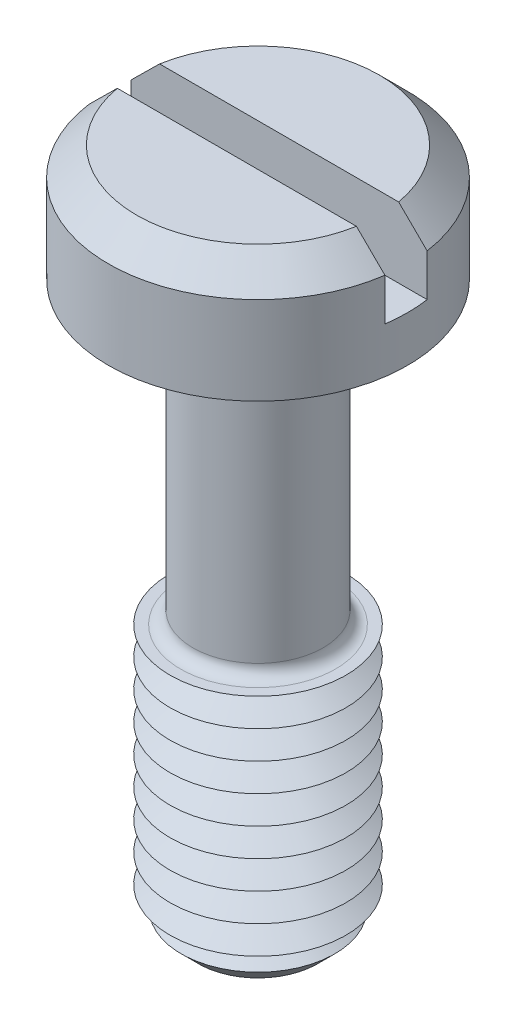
ISO-10303-21;
HEADER;
FILE_DESCRIPTION(('STEP AP214'),'2;1');
FILE_NAME('part.step','',(''),(''),'','','');
FILE_SCHEMA(('AUTOMOTIVE_DESIGN { 1 0 10303 214 1 1 1 1 }'));
ENDSEC;
DATA;
#1=APPLICATION_CONTEXT('core data for automotive mechanical design processes');
#2=APPLICATION_PROTOCOL_DEFINITION('international standard','automotive_design',2000,#1);
#3=PRODUCT_CONTEXT('',#1,'mechanical');
#4=PRODUCT('Part','Part','',(#3));
#5=PRODUCT_RELATED_PRODUCT_CATEGORY('part','',(#4));
#6=PRODUCT_DEFINITION_FORMATION('','',#4);
#7=PRODUCT_DEFINITION_CONTEXT('part definition',#1,'design');
#8=PRODUCT_DEFINITION('design','',#6,#7);
#9=PRODUCT_DEFINITION_SHAPE('','',#8);
#10=(LENGTH_UNIT() NAMED_UNIT(*) SI_UNIT(.MILLI.,.METRE.));
#11=(NAMED_UNIT(*) PLANE_ANGLE_UNIT() SI_UNIT($,.RADIAN.));
#12=(NAMED_UNIT(*) SI_UNIT($,.STERADIAN.) SOLID_ANGLE_UNIT());
#13=UNCERTAINTY_MEASURE_WITH_UNIT(LENGTH_MEASURE(1.E-05),#10,'distance_accuracy_value','');
#14=(GEOMETRIC_REPRESENTATION_CONTEXT(3) GLOBAL_UNCERTAINTY_ASSIGNED_CONTEXT((#13)) GLOBAL_UNIT_ASSIGNED_CONTEXT((#10,
#11,#12)) REPRESENTATION_CONTEXT('',''));
#15=CARTESIAN_POINT('',(0.,0.,0.));
#16=DIRECTION('',(0.,0.,1.));
#17=DIRECTION('',(1.,0.,0.));
#18=AXIS2_PLACEMENT_3D('',#15,#16,#17);
#19=CARTESIAN_POINT('',(0.,3.3,0.));
#20=DIRECTION('',(0.,1.,0.));
#21=DIRECTION('',(0.,0.,1.));
#22=AXIS2_PLACEMENT_3D('',#19,#20,#21);
#23=PLANE('',#22);
#24=DIRECTION('',(-1.,0.,0.));
#25=VECTOR('',#24,1.);
#26=CARTESIAN_POINT('',(4.25,3.3,-0.6));
#27=LINE('',#26,#25);
#28=CARTESIAN_POINT('',(3.39742549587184,3.3,-0.6));
#29=VERTEX_POINT('',#28);
#30=CARTESIAN_POINT('',(-3.39742549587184,3.3,-0.6));
#31=VERTEX_POINT('',#30);
#32=EDGE_CURVE('E110',#29,#31,#27,.T.);
#33=ORIENTED_EDGE('',*,*,#32,.F.);
#34=CARTESIAN_POINT('',(0.,3.3,0.));
#35=DIRECTION('',(0.,1.,0.));
#36=DIRECTION('',(0.,0.,1.));
#37=AXIS2_PLACEMENT_3D('',#34,#35,#36);
#38=CIRCLE('',#37,3.45000000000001);
#39=EDGE_CURVE('E113',#29,#31,#38,.T.);
#40=ORIENTED_EDGE('',*,*,#39,.T.);
#41=EDGE_LOOP('',(#33,#40));
#42=FACE_BOUND('',#41,.T.);
#43=ADVANCED_FACE('F39',(#42),#23,.T.);
#44=CARTESIAN_POINT('',(0.,3.3,0.));
#45=DIRECTION('',(0.,-1.,0.));
#46=DIRECTION('',(0.,0.,-1.));
#47=AXIS2_PLACEMENT_3D('',#44,#45,#46);
#48=CONICAL_SURFACE('',#47,3.45000000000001,0.785398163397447);
#49=CARTESIAN_POINT('',(9.35351408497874,-2.62273843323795,-0.6));
#50=CARTESIAN_POINT('',(9.03263557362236,-2.3025231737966,-0.6));
#51=CARTESIAN_POINT('',(8.71172811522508,-1.9823369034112,-0.6));
#52=CARTESIAN_POINT('',(8.06981262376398,-1.34205341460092,-0.6));
#53=CARTESIAN_POINT('',(7.74880458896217,-1.02195619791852,-0.6));
#54=CARTESIAN_POINT('',(7.10652460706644,-0.381761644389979,-0.6));
#55=CARTESIAN_POINT('',(6.78525260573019,-0.061664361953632,-0.6));
#56=CARTESIAN_POINT('',(6.14251393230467,0.578323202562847,-0.6));
#57=CARTESIAN_POINT('',(5.82104726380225,0.898213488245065,-0.6));
#58=CARTESIAN_POINT('',(5.17196209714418,1.54347500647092,-0.6));
#59=CARTESIAN_POINT('',(4.84433778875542,1.86884039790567,-0.6));
#60=CARTESIAN_POINT('',(4.35244442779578,2.35644593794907,-0.6));
#61=CARTESIAN_POINT('',(4.18839924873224,2.51891187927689,-0.6));
#62=CARTESIAN_POINT('',(3.86009606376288,2.84362679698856,-0.6));
#63=CARTESIAN_POINT('',(3.69583805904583,3.00587577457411,-0.6));
#64=CARTESIAN_POINT('',(3.36705354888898,3.33001661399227,-0.6));
#65=CARTESIAN_POINT('',(3.20252712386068,3.49190855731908,-0.6));
#66=CARTESIAN_POINT('',(2.87298689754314,3.81520272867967,-0.6));
#67=CARTESIAN_POINT('',(2.70797308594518,3.97660494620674,-0.6));
#68=CARTESIAN_POINT('',(2.37716903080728,4.29858210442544,-0.6));
#69=CARTESIAN_POINT('',(2.21137886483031,4.45915712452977,-0.6));
#70=CARTESIAN_POINT('',(1.96157219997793,4.69884609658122,-0.6));
#71=CARTESIAN_POINT('',(1.87811785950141,4.77854546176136,-0.6));
#72=CARTESIAN_POINT('',(1.71066064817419,4.93736532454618,-0.6));
#73=CARTESIAN_POINT('',(1.62665778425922,5.01648582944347,-0.6));
#74=CARTESIAN_POINT('',(1.49655488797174,5.13773269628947,-0.6));
#75=CARTESIAN_POINT('',(1.45074972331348,5.18017521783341,-0.6));
#76=CARTESIAN_POINT('',(1.35882119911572,5.26471614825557,-0.6));
#77=CARTESIAN_POINT('',(1.31269783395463,5.30681455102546,-0.6));
#78=CARTESIAN_POINT('',(1.22008852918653,5.39050695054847,-0.6));
#79=CARTESIAN_POINT('',(1.17360305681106,5.43210146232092,-0.6));
#80=CARTESIAN_POINT('',(1.08007401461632,5.51465347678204,-0.6));
#81=CARTESIAN_POINT('',(1.03303046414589,5.55561100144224,-0.6));
#82=CARTESIAN_POINT('',(0.919047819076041,5.65299331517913,-0.6));
#83=CARTESIAN_POINT('',(0.851738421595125,5.7089924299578,-0.6));
#84=CARTESIAN_POINT('',(0.748806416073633,5.79068526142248,-0.6));
#85=CARTESIAN_POINT('',(0.714125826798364,5.8175621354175,-0.6));
#86=CARTESIAN_POINT('',(0.643915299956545,5.87018079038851,-0.6));
#87=CARTESIAN_POINT('',(0.608385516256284,5.89592277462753,-0.6));
#88=CARTESIAN_POINT('',(0.545162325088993,5.93955652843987,-0.6));
#89=CARTESIAN_POINT('',(0.517718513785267,5.95780799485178,-0.6));
#90=CARTESIAN_POINT('',(0.462025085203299,5.99303174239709,-0.6));
#91=CARTESIAN_POINT('',(0.433775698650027,6.01000438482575,-0.6));
#92=CARTESIAN_POINT('',(0.376341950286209,6.04213837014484,-0.6));
#93=CARTESIAN_POINT('',(0.347160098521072,6.05730412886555,-0.6));
#94=CARTESIAN_POINT('',(0.2876425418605,6.08513394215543,-0.6));
#95=CARTESIAN_POINT('',(0.25730803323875,6.09780051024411,-0.6));
#96=CARTESIAN_POINT('',(0.190863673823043,6.12124627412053,-0.6));
#97=CARTESIAN_POINT('',(0.154554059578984,6.13148571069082,-0.6));
#98=CARTESIAN_POINT('',(0.0807909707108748,6.14565404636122,-0.6));
#99=CARTESIAN_POINT('',(0.0433423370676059,6.14960664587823,-0.6));
#100=CARTESIAN_POINT('',(-0.0317987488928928,6.1503378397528,-0.6));
#101=CARTESIAN_POINT('',(-0.0694915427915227,6.14708428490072,-0.6));
#102=CARTESIAN_POINT('',(-0.143790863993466,6.13410921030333,-0.6));
#103=CARTESIAN_POINT('',(-0.180393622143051,6.12436747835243,-0.6));
#104=CARTESIAN_POINT('',(-0.25409852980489,6.09939647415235,-0.6));
#105=CARTESIAN_POINT('',(-0.29109483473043,6.08386859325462,-0.6));
#106=CARTESIAN_POINT('',(-0.363408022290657,6.04924663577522,-0.6));
#107=CARTESIAN_POINT('',(-0.398721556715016,6.03014579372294,-0.6));
#108=CARTESIAN_POINT('',(-0.468234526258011,5.98944452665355,-0.6));
#109=CARTESIAN_POINT('',(-0.502422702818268,5.96782521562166,-0.6));
#110=CARTESIAN_POINT('',(-0.569689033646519,5.92300618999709,-0.6));
#111=CARTESIAN_POINT('',(-0.602768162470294,5.89980792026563,-0.6));
#112=CARTESIAN_POINT('',(-0.671148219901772,5.85008963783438,-0.6));
#113=CARTESIAN_POINT('',(-0.706369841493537,5.82346130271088,-0.6));
#114=CARTESIAN_POINT('',(-0.776087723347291,5.76926828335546,-0.6));
#115=CARTESIAN_POINT('',(-0.810583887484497,5.74170347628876,-0.6));
#116=CARTESIAN_POINT('',(-0.913286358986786,5.65798278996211,-0.6));
#117=CARTESIAN_POINT('',(-0.98067372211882,5.60082541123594,-0.6));
#118=CARTESIAN_POINT('',(-1.11424616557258,5.48490670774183,-0.6));
#119=CARTESIAN_POINT('',(-1.18042891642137,5.42614273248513,-0.6));
#120=CARTESIAN_POINT('',(-1.31191262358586,5.30767463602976,-0.6));
#121=CARTESIAN_POINT('',(-1.37721382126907,5.24797078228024,-0.6));
#122=CARTESIAN_POINT('',(-1.5070108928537,5.12812906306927,-0.6));
#123=CARTESIAN_POINT('',(-1.57150872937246,5.06799331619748,-0.6));
#124=CARTESIAN_POINT('',(-1.7000913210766,4.94727328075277,-0.6));
#125=CARTESIAN_POINT('',(-1.76417604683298,4.88668896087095,-0.6));
#126=CARTESIAN_POINT('',(-1.95584105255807,4.70458824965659,-0.6));
#127=CARTESIAN_POINT('',(-2.08296922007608,4.58259645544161,-0.6));
#128=CARTESIAN_POINT('',(-2.33599178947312,4.33840625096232,-0.6));
#129=CARTESIAN_POINT('',(-2.46188913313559,4.21621087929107,-0.6));
#130=CARTESIAN_POINT('',(-2.71323511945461,3.97135925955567,-0.6));
#131=CARTESIAN_POINT('',(-2.8386837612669,3.84870301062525,-0.6));
#132=CARTESIAN_POINT('',(-3.21459106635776,3.48027743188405,-0.6));
#133=CARTESIAN_POINT('',(-3.46460626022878,3.23405597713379,-0.6));
#134=CARTESIAN_POINT('',(-3.96413793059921,2.7409031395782,-0.6));
#135=CARTESIAN_POINT('',(-4.21365415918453,2.49397150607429,-0.6));
#136=CARTESIAN_POINT('',(-4.71232475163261,1.99974737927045,-0.6));
#137=CARTESIAN_POINT('',(-4.96147911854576,1.75245488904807,-0.6));
#138=CARTESIAN_POINT('',(-5.45958725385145,1.25761544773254,-0.6));
#139=CARTESIAN_POINT('',(-5.70854099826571,1.01006847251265,-0.6));
#140=CARTESIAN_POINT('',(-6.20629498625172,0.514819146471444,-0.6));
#141=CARTESIAN_POINT('',(-6.45509522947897,0.267116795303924,-0.6));
#142=CARTESIAN_POINT('',(-7.20128563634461,-0.476100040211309,-0.6));
#143=CARTESIAN_POINT('',(-7.69851620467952,-0.971774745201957,-0.6));
#144=CARTESIAN_POINT('',(-8.38865115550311,-1.66007026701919,-0.6));
#145=CARTESIAN_POINT('',(-8.58165346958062,-1.85259293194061,-0.6));
#146=CARTESIAN_POINT('',(-8.87112736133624,-2.14139225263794,-0.6));
#147=CARTESIAN_POINT('',(-8.96761014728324,-2.23765767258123,-0.6));
#148=CARTESIAN_POINT('',(-9.16056764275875,-2.43019387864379,-0.6));
#149=CARTESIAN_POINT('',(-9.25704235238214,-2.52646466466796,-0.6));
#150=CARTESIAN_POINT('',(-9.35351408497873,-2.62273843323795,-0.6));
#151=B_SPLINE_CURVE_WITH_KNOTS('',3,(#49,#50,#51,#52,#53,#54,#55,#56,#57,#58,#59,#60,#61,#62,
#63,#64,#65,#66,#67,#68,#69,#70,#71,#72,#73,#74,#75,#76,#77,#78,#79,#80,#81,#82,#83,#84,#85,#86,
#87,#88,#89,#90,#91,#92,#93,#94,#95,#96,#97,#98,#99,#100,#101,#102,#103,#104,#105,#106,#107,
#108,#109,#110,#111,#112,#113,#114,#115,#116,#117,#118,#119,#120,#121,#122,#123,#124,#125,#126,
#127,#128,#129,#130,#131,#132,#133,#134,#135,#136,#137,#138,#139,#140,#141,#142,#143,#144,#145,
#146,#147,#148,#149,#150),.UNSPECIFIED.,.F.,.F.,(4,2,2,2,2,2,2,2,2,2,2,2,2,2,2,2,2,2,2,2,2,2,2,
2,2,2,2,2,2,2,2,2,2,2,2,2,2,2,2,2,2,2,2,2,2,2,2,2,2,2,4),(0.,1.35996600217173,2.71995696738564,
4.08050889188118,5.44103646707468,6.82624457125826,7.5188872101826,8.21152599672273,
8.9039856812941,9.59646011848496,10.288866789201,10.635058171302,10.9812451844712,
11.1685812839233,11.3559207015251,11.5430489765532,11.7301707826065,11.9927784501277,
12.1243921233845,12.2559821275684,12.3548333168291,12.4536564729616,12.5522329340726,
12.6507097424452,12.763461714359,12.8757876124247,12.9886156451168,13.101796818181,
13.2218851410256,13.3422031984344,13.4634899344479,13.584667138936,13.7171086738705,
13.8495676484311,14.1146090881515,14.3801178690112,14.6455524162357,14.910099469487,
15.17466516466,15.7032346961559,16.2295761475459,16.7559185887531,17.8086237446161,
18.8617626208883,19.9148925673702,20.9681337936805,22.0213773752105,24.1276499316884,
24.9454725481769,25.354353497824,25.7632286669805),.UNSPECIFIED.);
#152=CARTESIAN_POINT('',(4.20743389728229,2.5,-0.6));
#153=VERTEX_POINT('',#152);
#154=EDGE_CURVE('E268',#153,#29,#151,.T.);
#155=ORIENTED_EDGE('',*,*,#154,.F.);
#156=CARTESIAN_POINT('',(0.,2.5,0.));
#157=DIRECTION('',(0.,1.,0.));
#158=DIRECTION('',(0.,0.,1.));
#159=AXIS2_PLACEMENT_3D('',#156,#157,#158);
#160=CIRCLE('',#159,4.25);
#161=CARTESIAN_POINT('',(-4.20743389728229,2.5,-0.6));
#162=VERTEX_POINT('',#161);
#163=EDGE_CURVE('E128',#162,#153,#160,.F.);
#164=ORIENTED_EDGE('',*,*,#163,.F.);
#165=EDGE_CURVE('E102',#31,#162,#151,.T.);
#166=ORIENTED_EDGE('',*,*,#165,.F.);
#167=ORIENTED_EDGE('',*,*,#39,.F.);
#168=EDGE_LOOP('',(#155,#164,#166,#167));
#169=FACE_BOUND('',#168,.T.);
#170=ADVANCED_FACE('F230',(#169),#48,.T.);
#171=CARTESIAN_POINT('',(0.,-16.,0.));
#172=DIRECTION('',(0.,1.,0.));
#173=DIRECTION('',(0.,0.,1.));
#174=AXIS2_PLACEMENT_3D('',#171,#172,#173);
#175=CYLINDRICAL_SURFACE('',#174,1.85);
#176=CARTESIAN_POINT('',(0.,-8.15,0.));
#177=DIRECTION('',(0.,-1.,0.));
#178=DIRECTION('',(0.,0.,-1.));
#179=AXIS2_PLACEMENT_3D('',#176,#177,#178);
#180=CIRCLE('',#179,1.85);
#181=CARTESIAN_POINT('',(0.,-8.15,-1.85));
#182=VERTEX_POINT('',#181);
#183=EDGE_CURVE('E123',#182,#182,#180,.F.);
#184=ORIENTED_EDGE('',*,*,#183,.T.);
#185=EDGE_LOOP('',(#184));
#186=FACE_BOUND('',#185,.T.);
#187=CARTESIAN_POINT('',(0.,-0.35,0.));
#188=DIRECTION('',(0.,1.,0.));
#189=DIRECTION('',(0.,0.,1.));
#190=AXIS2_PLACEMENT_3D('',#187,#188,#189);
#191=CIRCLE('',#190,1.85);
#192=CARTESIAN_POINT('',(0.,-0.35,1.85));
#193=VERTEX_POINT('',#192);
#194=EDGE_CURVE('E381',#193,#193,#191,.F.);
#195=ORIENTED_EDGE('',*,*,#194,.T.);
#196=EDGE_LOOP('',(#195));
#197=FACE_BOUND('',#196,.T.);
#198=ADVANCED_FACE('F226',(#186,#197),#175,.T.);
#199=CARTESIAN_POINT('',(0.,3.3,0.));
#200=DIRECTION('',(0.,-1.,0.));
#201=DIRECTION('',(0.,0.,-1.));
#202=AXIS2_PLACEMENT_3D('',#199,#200,#201);
#203=CYLINDRICAL_SURFACE('',#202,4.25);
#204=ORIENTED_EDGE('',*,*,#163,.T.);
#205=DIRECTION('',(0.,-1.,0.));
#206=VECTOR('',#205,1.);
#207=CARTESIAN_POINT('',(4.20743389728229,3.3,-0.6));
#208=LINE('',#207,#206);
#209=CARTESIAN_POINT('',(4.20743389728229,1.3,-0.6));
#210=VERTEX_POINT('',#209);
#211=EDGE_CURVE('E64',#153,#210,#208,.T.);
#212=ORIENTED_EDGE('',*,*,#211,.T.);
#213=CARTESIAN_POINT('',(0.,1.3,0.));
#214=DIRECTION('',(0.,1.,0.));
#215=DIRECTION('',(0.,0.,1.));
#216=AXIS2_PLACEMENT_3D('',#213,#214,#215);
#217=CIRCLE('',#216,4.25);
#218=CARTESIAN_POINT('',(4.20743389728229,1.3,0.6));
#219=VERTEX_POINT('',#218);
#220=EDGE_CURVE('E11',#219,#210,#217,.T.);
#221=ORIENTED_EDGE('',*,*,#220,.F.);
#222=DIRECTION('',(0.,-1.,0.));
#223=VECTOR('',#222,1.);
#224=CARTESIAN_POINT('',(4.20743389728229,3.3,0.6));
#225=LINE('',#224,#223);
#226=CARTESIAN_POINT('',(4.20743389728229,2.5,0.6));
#227=VERTEX_POINT('',#226);
#228=EDGE_CURVE('E283',#219,#227,#225,.F.);
#229=ORIENTED_EDGE('',*,*,#228,.T.);
#230=CARTESIAN_POINT('',(-4.20743389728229,2.5,0.6));
#231=VERTEX_POINT('',#230);
#232=EDGE_CURVE('E120',#227,#231,#160,.F.);
#233=ORIENTED_EDGE('',*,*,#232,.T.);
#234=DIRECTION('',(0.,-1.,0.));
#235=VECTOR('',#234,1.);
#236=CARTESIAN_POINT('',(-4.20743389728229,3.3,0.6));
#237=LINE('',#236,#235);
#238=CARTESIAN_POINT('',(-4.20743389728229,1.3,0.6));
#239=VERTEX_POINT('',#238);
#240=EDGE_CURVE('E96',#231,#239,#237,.T.);
#241=ORIENTED_EDGE('',*,*,#240,.T.);
#242=CARTESIAN_POINT('',(-4.20743389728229,1.3,-0.6));
#243=VERTEX_POINT('',#242);
#244=EDGE_CURVE('E44',#243,#239,#217,.T.);
#245=ORIENTED_EDGE('',*,*,#244,.F.);
#246=DIRECTION('',(0.,-1.,0.));
#247=VECTOR('',#246,1.);
#248=CARTESIAN_POINT('',(-4.20743389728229,3.3,-0.6));
#249=LINE('',#248,#247);
#250=EDGE_CURVE('E288',#243,#162,#249,.F.);
#251=ORIENTED_EDGE('',*,*,#250,.T.);
#252=EDGE_LOOP('',(#204,#212,#221,#229,#233,#241,#245,#251));
#253=FACE_BOUND('',#252,.T.);
#254=CARTESIAN_POINT('',(0.,0.,0.));
#255=DIRECTION('',(0.,1.,0.));
#256=DIRECTION('',(0.,0.,1.));
#257=AXIS2_PLACEMENT_3D('',#254,#255,#256);
#258=CIRCLE('',#257,4.25);
#259=CARTESIAN_POINT('',(0.,0.,4.25));
#260=VERTEX_POINT('',#259);
#261=EDGE_CURVE('E369',#260,#260,#258,.T.);
#262=ORIENTED_EDGE('',*,*,#261,.T.);
#263=EDGE_LOOP('',(#262));
#264=FACE_BOUND('',#263,.T.);
#265=ADVANCED_FACE('F229',(#253,#264),#203,.T.);
#266=DIRECTION('',(1.,0.,0.));
#267=VECTOR('',#266,1.);
#268=CARTESIAN_POINT('',(4.25,3.3,0.6));
#269=LINE('',#268,#267);
#270=CARTESIAN_POINT('',(-3.39742549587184,3.3,0.6));
#271=VERTEX_POINT('',#270);
#272=CARTESIAN_POINT('',(3.39742549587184,3.3,0.6));
#273=VERTEX_POINT('',#272);
#274=EDGE_CURVE('E56',#271,#273,#269,.T.);
#275=ORIENTED_EDGE('',*,*,#274,.F.);
#276=EDGE_CURVE('E108',#271,#273,#38,.T.);
#277=ORIENTED_EDGE('',*,*,#276,.T.);
#278=EDGE_LOOP('',(#275,#277));
#279=FACE_BOUND('',#278,.T.);
#280=ADVANCED_FACE('F107',(#279),#23,.T.);
#281=CARTESIAN_POINT('',(0.,0.,0.));
#282=DIRECTION('',(0.,1.,0.));
#283=DIRECTION('',(0.,0.,1.));
#284=AXIS2_PLACEMENT_3D('',#281,#282,#283);
#285=PLANE('',#284);
#286=CARTESIAN_POINT('',(0.,0.,0.));
#287=DIRECTION('',(0.,1.,0.));
#288=DIRECTION('',(0.,0.,1.));
#289=AXIS2_PLACEMENT_3D('',#286,#287,#288);
#290=CIRCLE('',#289,2.2);
#291=CARTESIAN_POINT('',(0.,0.,2.2));
#292=VERTEX_POINT('',#291);
#293=EDGE_CURVE('E114',#292,#292,#290,.T.);
#294=ORIENTED_EDGE('',*,*,#293,.T.);
#295=EDGE_LOOP('',(#294));
#296=FACE_BOUND('',#295,.T.);
#297=ORIENTED_EDGE('',*,*,#261,.F.);
#298=EDGE_LOOP('',(#297));
#299=FACE_BOUND('',#298,.T.);
#300=ADVANCED_FACE('F220',(#296,#299),#285,.F.);
#301=CARTESIAN_POINT('',(0.,-8.5,0.));
#302=DIRECTION('',(0.,-1.,0.));
#303=DIRECTION('',(0.,0.,-1.));
#304=AXIS2_PLACEMENT_3D('',#301,#302,#303);
#305=PLANE('',#304);
#306=CARTESIAN_POINT('',(0.,-8.5,0.));
#307=DIRECTION('',(0.,-1.,0.));
#308=DIRECTION('',(0.,0.,-1.));
#309=AXIS2_PLACEMENT_3D('',#306,#307,#308);
#310=CIRCLE('',#309,2.2);
#311=CARTESIAN_POINT('',(0.,-8.5,-2.2));
#312=VERTEX_POINT('',#311);
#313=EDGE_CURVE('E376',#312,#312,#310,.T.);
#314=ORIENTED_EDGE('',*,*,#313,.T.);
#315=EDGE_LOOP('',(#314));
#316=FACE_BOUND('',#315,.T.);
#317=CARTESIAN_POINT('',(0.,-8.5,0.));
#318=DIRECTION('',(0.,1.,0.));
#319=DIRECTION('',(0.,0.,1.));
#320=AXIS2_PLACEMENT_3D('',#317,#318,#319);
#321=CIRCLE('',#320,2.5);
#322=CARTESIAN_POINT('',(0.,-8.5,2.5));
#323=VERTEX_POINT('',#322);
#324=EDGE_CURVE('E365',#323,#323,#321,.T.);
#325=ORIENTED_EDGE('',*,*,#324,.T.);
#326=EDGE_LOOP('',(#325));
#327=FACE_BOUND('',#326,.T.);
#328=ADVANCED_FACE('F216',(#316,#327),#305,.F.);
#329=CARTESIAN_POINT('',(0.,-8.9,0.));
#330=DIRECTION('',(0.,1.,0.));
#331=DIRECTION('',(0.,0.,1.));
#332=AXIS2_PLACEMENT_3D('',#329,#330,#331);
#333=CONICAL_SURFACE('',#332,1.80717967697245,1.0471975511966);
#334=ORIENTED_EDGE('',*,*,#324,.F.);
#335=EDGE_LOOP('',(#334));
#336=FACE_BOUND('',#335,.T.);
#337=CARTESIAN_POINT('',(0.,-8.9,0.));
#338=DIRECTION('',(0.,1.,0.));
#339=DIRECTION('',(0.,0.,1.));
#340=AXIS2_PLACEMENT_3D('',#337,#338,#339);
#341=CIRCLE('',#340,1.80717967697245);
#342=CARTESIAN_POINT('',(0.,-8.9,1.80717967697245));
#343=VERTEX_POINT('',#342);
#344=EDGE_CURVE('E361',#343,#343,#341,.T.);
#345=ORIENTED_EDGE('',*,*,#344,.T.);
#346=EDGE_LOOP('',(#345));
#347=FACE_BOUND('',#346,.T.);
#348=ADVANCED_FACE('F212',(#336,#347),#333,.T.);
#349=CARTESIAN_POINT('',(0.,-9.3,0.));
#350=DIRECTION('',(0.,-1.,0.));
#351=DIRECTION('',(0.,0.,-1.));
#352=AXIS2_PLACEMENT_3D('',#349,#350,#351);
#353=CONICAL_SURFACE('',#352,2.5,1.0471975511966);
#354=ORIENTED_EDGE('',*,*,#344,.F.);
#355=EDGE_LOOP('',(#354));
#356=FACE_BOUND('',#355,.T.);
#357=CARTESIAN_POINT('',(0.,-9.3,0.));
#358=DIRECTION('',(0.,1.,0.));
#359=DIRECTION('',(0.,0.,1.));
#360=AXIS2_PLACEMENT_3D('',#357,#358,#359);
#361=CIRCLE('',#360,2.5);
#362=CARTESIAN_POINT('',(0.,-9.3,2.5));
#363=VERTEX_POINT('',#362);
#364=EDGE_CURVE('E357',#363,#363,#361,.T.);
#365=ORIENTED_EDGE('',*,*,#364,.T.);
#366=EDGE_LOOP('',(#365));
#367=FACE_BOUND('',#366,.T.);
#368=ADVANCED_FACE('F208',(#356,#367),#353,.T.);
#369=CARTESIAN_POINT('',(0.,-9.7,0.));
#370=DIRECTION('',(0.,1.,0.));
#371=DIRECTION('',(0.,0.,1.));
#372=AXIS2_PLACEMENT_3D('',#369,#370,#371);
#373=CONICAL_SURFACE('',#372,1.80717967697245,1.0471975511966);
#374=ORIENTED_EDGE('',*,*,#364,.F.);
#375=EDGE_LOOP('',(#374));
#376=FACE_BOUND('',#375,.T.);
#377=CARTESIAN_POINT('',(0.,-9.7,0.));
#378=DIRECTION('',(0.,1.,0.));
#379=DIRECTION('',(0.,0.,1.));
#380=AXIS2_PLACEMENT_3D('',#377,#378,#379);
#381=CIRCLE('',#380,1.80717967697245);
#382=CARTESIAN_POINT('',(0.,-9.7,1.80717967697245));
#383=VERTEX_POINT('',#382);
#384=EDGE_CURVE('E353',#383,#383,#381,.T.);
#385=ORIENTED_EDGE('',*,*,#384,.T.);
#386=EDGE_LOOP('',(#385));
#387=FACE_BOUND('',#386,.T.);
#388=ADVANCED_FACE('F204',(#376,#387),#373,.T.);
#389=CARTESIAN_POINT('',(0.,-10.1,0.));
#390=DIRECTION('',(0.,-1.,0.));
#391=DIRECTION('',(0.,0.,-1.));
#392=AXIS2_PLACEMENT_3D('',#389,#390,#391);
#393=CONICAL_SURFACE('',#392,2.5,1.0471975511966);
#394=ORIENTED_EDGE('',*,*,#384,.F.);
#395=EDGE_LOOP('',(#394));
#396=FACE_BOUND('',#395,.T.);
#397=CARTESIAN_POINT('',(0.,-10.1,0.));
#398=DIRECTION('',(0.,1.,0.));
#399=DIRECTION('',(0.,0.,1.));
#400=AXIS2_PLACEMENT_3D('',#397,#398,#399);
#401=CIRCLE('',#400,2.5);
#402=CARTESIAN_POINT('',(0.,-10.1,2.5));
#403=VERTEX_POINT('',#402);
#404=EDGE_CURVE('E349',#403,#403,#401,.T.);
#405=ORIENTED_EDGE('',*,*,#404,.T.);
#406=EDGE_LOOP('',(#405));
#407=FACE_BOUND('',#406,.T.);
#408=ADVANCED_FACE('F200',(#396,#407),#393,.T.);
#409=CARTESIAN_POINT('',(0.,-10.5,0.));
#410=DIRECTION('',(0.,1.,0.));
#411=DIRECTION('',(0.,0.,1.));
#412=AXIS2_PLACEMENT_3D('',#409,#410,#411);
#413=CONICAL_SURFACE('',#412,1.80717967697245,1.0471975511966);
#414=ORIENTED_EDGE('',*,*,#404,.F.);
#415=EDGE_LOOP('',(#414));
#416=FACE_BOUND('',#415,.T.);
#417=CARTESIAN_POINT('',(0.,-10.5,0.));
#418=DIRECTION('',(0.,1.,0.));
#419=DIRECTION('',(0.,0.,1.));
#420=AXIS2_PLACEMENT_3D('',#417,#418,#419);
#421=CIRCLE('',#420,1.80717967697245);
#422=CARTESIAN_POINT('',(0.,-10.5,1.80717967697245));
#423=VERTEX_POINT('',#422);
#424=EDGE_CURVE('E345',#423,#423,#421,.T.);
#425=ORIENTED_EDGE('',*,*,#424,.T.);
#426=EDGE_LOOP('',(#425));
#427=FACE_BOUND('',#426,.T.);
#428=ADVANCED_FACE('F196',(#416,#427),#413,.T.);
#429=CARTESIAN_POINT('',(0.,-10.9,0.));
#430=DIRECTION('',(0.,-1.,0.));
#431=DIRECTION('',(0.,0.,-1.));
#432=AXIS2_PLACEMENT_3D('',#429,#430,#431);
#433=CONICAL_SURFACE('',#432,2.5,1.0471975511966);
#434=ORIENTED_EDGE('',*,*,#424,.F.);
#435=EDGE_LOOP('',(#434));
#436=FACE_BOUND('',#435,.T.);
#437=CARTESIAN_POINT('',(0.,-10.9,0.));
#438=DIRECTION('',(0.,1.,0.));
#439=DIRECTION('',(0.,0.,1.));
#440=AXIS2_PLACEMENT_3D('',#437,#438,#439);
#441=CIRCLE('',#440,2.5);
#442=CARTESIAN_POINT('',(0.,-10.9,2.5));
#443=VERTEX_POINT('',#442);
#444=EDGE_CURVE('E341',#443,#443,#441,.T.);
#445=ORIENTED_EDGE('',*,*,#444,.T.);
#446=EDGE_LOOP('',(#445));
#447=FACE_BOUND('',#446,.T.);
#448=ADVANCED_FACE('F192',(#436,#447),#433,.T.);
#449=CARTESIAN_POINT('',(0.,-11.3,0.));
#450=DIRECTION('',(0.,1.,0.));
#451=DIRECTION('',(0.,0.,1.));
#452=AXIS2_PLACEMENT_3D('',#449,#450,#451);
#453=CONICAL_SURFACE('',#452,1.80717967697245,1.0471975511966);
#454=ORIENTED_EDGE('',*,*,#444,.F.);
#455=EDGE_LOOP('',(#454));
#456=FACE_BOUND('',#455,.T.);
#457=CARTESIAN_POINT('',(0.,-11.3,0.));
#458=DIRECTION('',(0.,1.,0.));
#459=DIRECTION('',(0.,0.,1.));
#460=AXIS2_PLACEMENT_3D('',#457,#458,#459);
#461=CIRCLE('',#460,1.80717967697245);
#462=CARTESIAN_POINT('',(0.,-11.3,1.80717967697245));
#463=VERTEX_POINT('',#462);
#464=EDGE_CURVE('E337',#463,#463,#461,.T.);
#465=ORIENTED_EDGE('',*,*,#464,.T.);
#466=EDGE_LOOP('',(#465));
#467=FACE_BOUND('',#466,.T.);
#468=ADVANCED_FACE('F188',(#456,#467),#453,.T.);
#469=CARTESIAN_POINT('',(0.,-11.7,0.));
#470=DIRECTION('',(0.,-1.,0.));
#471=DIRECTION('',(0.,0.,-1.));
#472=AXIS2_PLACEMENT_3D('',#469,#470,#471);
#473=CONICAL_SURFACE('',#472,2.5,1.0471975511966);
#474=ORIENTED_EDGE('',*,*,#464,.F.);
#475=EDGE_LOOP('',(#474));
#476=FACE_BOUND('',#475,.T.);
#477=CARTESIAN_POINT('',(0.,-11.7,0.));
#478=DIRECTION('',(0.,1.,0.));
#479=DIRECTION('',(0.,0.,1.));
#480=AXIS2_PLACEMENT_3D('',#477,#478,#479);
#481=CIRCLE('',#480,2.5);
#482=CARTESIAN_POINT('',(0.,-11.7,2.5));
#483=VERTEX_POINT('',#482);
#484=EDGE_CURVE('E333',#483,#483,#481,.T.);
#485=ORIENTED_EDGE('',*,*,#484,.T.);
#486=EDGE_LOOP('',(#485));
#487=FACE_BOUND('',#486,.T.);
#488=ADVANCED_FACE('F184',(#476,#487),#473,.T.);
#489=CARTESIAN_POINT('',(0.,-12.1,0.));
#490=DIRECTION('',(0.,1.,0.));
#491=DIRECTION('',(0.,0.,1.));
#492=AXIS2_PLACEMENT_3D('',#489,#490,#491);
#493=CONICAL_SURFACE('',#492,1.80717967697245,1.0471975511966);
#494=ORIENTED_EDGE('',*,*,#484,.F.);
#495=EDGE_LOOP('',(#494));
#496=FACE_BOUND('',#495,.T.);
#497=CARTESIAN_POINT('',(0.,-12.1,0.));
#498=DIRECTION('',(0.,1.,0.));
#499=DIRECTION('',(0.,0.,1.));
#500=AXIS2_PLACEMENT_3D('',#497,#498,#499);
#501=CIRCLE('',#500,1.80717967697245);
#502=CARTESIAN_POINT('',(0.,-12.1,1.80717967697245));
#503=VERTEX_POINT('',#502);
#504=EDGE_CURVE('E329',#503,#503,#501,.T.);
#505=ORIENTED_EDGE('',*,*,#504,.T.);
#506=EDGE_LOOP('',(#505));
#507=FACE_BOUND('',#506,.T.);
#508=ADVANCED_FACE('F180',(#496,#507),#493,.T.);
#509=CARTESIAN_POINT('',(0.,-12.5,0.));
#510=DIRECTION('',(0.,-1.,0.));
#511=DIRECTION('',(0.,0.,-1.));
#512=AXIS2_PLACEMENT_3D('',#509,#510,#511);
#513=CONICAL_SURFACE('',#512,2.5,1.0471975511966);
#514=ORIENTED_EDGE('',*,*,#504,.F.);
#515=EDGE_LOOP('',(#514));
#516=FACE_BOUND('',#515,.T.);
#517=CARTESIAN_POINT('',(0.,-12.5,0.));
#518=DIRECTION('',(0.,1.,0.));
#519=DIRECTION('',(0.,0.,1.));
#520=AXIS2_PLACEMENT_3D('',#517,#518,#519);
#521=CIRCLE('',#520,2.5);
#522=CARTESIAN_POINT('',(0.,-12.5,2.5));
#523=VERTEX_POINT('',#522);
#524=EDGE_CURVE('E325',#523,#523,#521,.T.);
#525=ORIENTED_EDGE('',*,*,#524,.T.);
#526=EDGE_LOOP('',(#525));
#527=FACE_BOUND('',#526,.T.);
#528=ADVANCED_FACE('F176',(#516,#527),#513,.T.);
#529=CARTESIAN_POINT('',(0.,-12.9,0.));
#530=DIRECTION('',(0.,1.,0.));
#531=DIRECTION('',(0.,0.,1.));
#532=AXIS2_PLACEMENT_3D('',#529,#530,#531);
#533=CONICAL_SURFACE('',#532,1.80717967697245,1.0471975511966);
#534=ORIENTED_EDGE('',*,*,#524,.F.);
#535=EDGE_LOOP('',(#534));
#536=FACE_BOUND('',#535,.T.);
#537=CARTESIAN_POINT('',(0.,-12.9,0.));
#538=DIRECTION('',(0.,1.,0.));
#539=DIRECTION('',(0.,0.,1.));
#540=AXIS2_PLACEMENT_3D('',#537,#538,#539);
#541=CIRCLE('',#540,1.80717967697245);
#542=CARTESIAN_POINT('',(0.,-12.9,1.80717967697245));
#543=VERTEX_POINT('',#542);
#544=EDGE_CURVE('E322',#543,#543,#541,.T.);
#545=ORIENTED_EDGE('',*,*,#544,.T.);
#546=EDGE_LOOP('',(#545));
#547=FACE_BOUND('',#546,.T.);
#548=ADVANCED_FACE('F172',(#536,#547),#533,.T.);
#549=CARTESIAN_POINT('',(0.,-13.3,0.));
#550=DIRECTION('',(0.,-1.,0.));
#551=DIRECTION('',(0.,0.,-1.));
#552=AXIS2_PLACEMENT_3D('',#549,#550,#551);
#553=CONICAL_SURFACE('',#552,2.5,1.0471975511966);
#554=ORIENTED_EDGE('',*,*,#544,.F.);
#555=EDGE_LOOP('',(#554));
#556=FACE_BOUND('',#555,.T.);
#557=CARTESIAN_POINT('',(0.,-13.3,0.));
#558=DIRECTION('',(0.,1.,0.));
#559=DIRECTION('',(0.,0.,1.));
#560=AXIS2_PLACEMENT_3D('',#557,#558,#559);
#561=CIRCLE('',#560,2.5);
#562=CARTESIAN_POINT('',(0.,-13.3,2.5));
#563=VERTEX_POINT('',#562);
#564=EDGE_CURVE('E318',#563,#563,#561,.T.);
#565=ORIENTED_EDGE('',*,*,#564,.T.);
#566=EDGE_LOOP('',(#565));
#567=FACE_BOUND('',#566,.T.);
#568=ADVANCED_FACE('F168',(#556,#567),#553,.T.);
#569=CARTESIAN_POINT('',(0.,-13.7,0.));
#570=DIRECTION('',(0.,1.,0.));
#571=DIRECTION('',(0.,0.,1.));
#572=AXIS2_PLACEMENT_3D('',#569,#570,#571);
#573=CONICAL_SURFACE('',#572,1.80717967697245,1.0471975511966);
#574=ORIENTED_EDGE('',*,*,#564,.F.);
#575=EDGE_LOOP('',(#574));
#576=FACE_BOUND('',#575,.T.);
#577=CARTESIAN_POINT('',(0.,-13.7,0.));
#578=DIRECTION('',(0.,1.,0.));
#579=DIRECTION('',(0.,0.,1.));
#580=AXIS2_PLACEMENT_3D('',#577,#578,#579);
#581=CIRCLE('',#580,1.80717967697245);
#582=CARTESIAN_POINT('',(0.,-13.7,1.80717967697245));
#583=VERTEX_POINT('',#582);
#584=EDGE_CURVE('E314',#583,#583,#581,.T.);
#585=ORIENTED_EDGE('',*,*,#584,.T.);
#586=EDGE_LOOP('',(#585));
#587=FACE_BOUND('',#586,.T.);
#588=ADVANCED_FACE('F164',(#576,#587),#573,.T.);
#589=CARTESIAN_POINT('',(0.,-14.1,0.));
#590=DIRECTION('',(0.,-1.,0.));
#591=DIRECTION('',(0.,0.,-1.));
#592=AXIS2_PLACEMENT_3D('',#589,#590,#591);
#593=CONICAL_SURFACE('',#592,2.5,1.0471975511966);
#594=ORIENTED_EDGE('',*,*,#584,.F.);
#595=EDGE_LOOP('',(#594));
#596=FACE_BOUND('',#595,.T.);
#597=CARTESIAN_POINT('',(0.,-14.1,0.));
#598=DIRECTION('',(0.,1.,0.));
#599=DIRECTION('',(0.,0.,1.));
#600=AXIS2_PLACEMENT_3D('',#597,#598,#599);
#601=CIRCLE('',#600,2.5);
#602=CARTESIAN_POINT('',(0.,-14.1,2.5));
#603=VERTEX_POINT('',#602);
#604=EDGE_CURVE('E310',#603,#603,#601,.T.);
#605=ORIENTED_EDGE('',*,*,#604,.T.);
#606=EDGE_LOOP('',(#605));
#607=FACE_BOUND('',#606,.T.);
#608=ADVANCED_FACE('F160',(#596,#607),#593,.T.);
#609=CARTESIAN_POINT('',(0.,-14.5,0.));
#610=DIRECTION('',(0.,1.,0.));
#611=DIRECTION('',(0.,0.,1.));
#612=AXIS2_PLACEMENT_3D('',#609,#610,#611);
#613=CONICAL_SURFACE('',#612,1.80717967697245,1.0471975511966);
#614=ORIENTED_EDGE('',*,*,#604,.F.);
#615=EDGE_LOOP('',(#614));
#616=FACE_BOUND('',#615,.T.);
#617=CARTESIAN_POINT('',(0.,-14.5,0.));
#618=DIRECTION('',(0.,1.,0.));
#619=DIRECTION('',(0.,0.,1.));
#620=AXIS2_PLACEMENT_3D('',#617,#618,#619);
#621=CIRCLE('',#620,1.80717967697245);
#622=CARTESIAN_POINT('',(0.,-14.5,1.80717967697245));
#623=VERTEX_POINT('',#622);
#624=EDGE_CURVE('E306',#623,#623,#621,.T.);
#625=ORIENTED_EDGE('',*,*,#624,.T.);
#626=EDGE_LOOP('',(#625));
#627=FACE_BOUND('',#626,.T.);
#628=ADVANCED_FACE('F156',(#616,#627),#613,.T.);
#629=CARTESIAN_POINT('',(0.,-14.9,0.));
#630=DIRECTION('',(0.,-1.,0.));
#631=DIRECTION('',(0.,0.,-1.));
#632=AXIS2_PLACEMENT_3D('',#629,#630,#631);
#633=CONICAL_SURFACE('',#632,2.5,1.0471975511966);
#634=ORIENTED_EDGE('',*,*,#624,.F.);
#635=EDGE_LOOP('',(#634));
#636=FACE_BOUND('',#635,.T.);
#637=CARTESIAN_POINT('',(0.,-14.9,0.));
#638=DIRECTION('',(0.,1.,0.));
#639=DIRECTION('',(0.,0.,1.));
#640=AXIS2_PLACEMENT_3D('',#637,#638,#639);
#641=CIRCLE('',#640,2.5);
#642=CARTESIAN_POINT('',(0.,-14.9,2.5));
#643=VERTEX_POINT('',#642);
#644=EDGE_CURVE('E302',#643,#643,#641,.T.);
#645=ORIENTED_EDGE('',*,*,#644,.T.);
#646=EDGE_LOOP('',(#645));
#647=FACE_BOUND('',#646,.T.);
#648=ADVANCED_FACE('F152',(#636,#647),#633,.T.);
#649=CARTESIAN_POINT('',(0.,-15.3,0.));
#650=DIRECTION('',(0.,1.,0.));
#651=DIRECTION('',(0.,0.,1.));
#652=AXIS2_PLACEMENT_3D('',#649,#650,#651);
#653=CONICAL_SURFACE('',#652,1.80717967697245,1.0471975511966);
#654=ORIENTED_EDGE('',*,*,#644,.F.);
#655=EDGE_LOOP('',(#654));
#656=FACE_BOUND('',#655,.T.);
#657=CARTESIAN_POINT('',(0.,-15.3,0.));
#658=DIRECTION('',(0.,1.,0.));
#659=DIRECTION('',(0.,0.,1.));
#660=AXIS2_PLACEMENT_3D('',#657,#658,#659);
#661=CIRCLE('',#660,1.80717967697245);
#662=CARTESIAN_POINT('',(0.,-15.3,1.80717967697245));
#663=VERTEX_POINT('',#662);
#664=EDGE_CURVE('E298',#663,#663,#661,.T.);
#665=ORIENTED_EDGE('',*,*,#664,.T.);
#666=EDGE_LOOP('',(#665));
#667=FACE_BOUND('',#666,.T.);
#668=ADVANCED_FACE('F148',(#656,#667),#653,.T.);
#669=CARTESIAN_POINT('',(0.,-15.7,0.));
#670=DIRECTION('',(0.,-1.,0.));
#671=DIRECTION('',(0.,0.,-1.));
#672=AXIS2_PLACEMENT_3D('',#669,#670,#671);
#673=CONICAL_SURFACE('',#672,2.5,1.0471975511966);
#674=CARTESIAN_POINT('',(0.,-15.5169872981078,0.));
#675=DIRECTION('',(0.,-1.,0.));
#676=DIRECTION('',(0.,0.,-1.));
#677=AXIS2_PLACEMENT_3D('',#674,#675,#676);
#678=CIRCLE('',#677,2.18301270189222);
#679=CARTESIAN_POINT('',(0.,-15.5169872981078,-2.18301270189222));
#680=VERTEX_POINT('',#679);
#681=EDGE_CURVE('E305',#680,#680,#678,.F.);
#682=ORIENTED_EDGE('',*,*,#681,.T.);
#683=EDGE_LOOP('',(#682));
#684=FACE_BOUND('',#683,.T.);
#685=ORIENTED_EDGE('',*,*,#664,.F.);
#686=EDGE_LOOP('',(#685));
#687=FACE_BOUND('',#686,.T.);
#688=ADVANCED_FACE('F144',(#684,#687),#673,.T.);
#689=CARTESIAN_POINT('',(0.,-16.,0.));
#690=DIRECTION('',(0.,-1.,0.));
#691=DIRECTION('',(0.,0.,-1.));
#692=AXIS2_PLACEMENT_3D('',#689,#690,#691);
#693=PLANE('',#692);
#694=CARTESIAN_POINT('',(0.,-16.,0.));
#695=DIRECTION('',(0.,-1.,0.));
#696=DIRECTION('',(0.,0.,-1.));
#697=AXIS2_PLACEMENT_3D('',#694,#695,#696);
#698=CIRCLE('',#697,1.7);
#699=CARTESIAN_POINT('',(0.,-16.,-1.7));
#700=VERTEX_POINT('',#699);
#701=EDGE_CURVE('E372',#700,#700,#698,.T.);
#702=ORIENTED_EDGE('',*,*,#701,.T.);
#703=EDGE_LOOP('',(#702));
#704=FACE_BOUND('',#703,.T.);
#705=ADVANCED_FACE('F147',(#704),#693,.T.);
#706=CARTESIAN_POINT('',(0.,-16.,0.));
#707=DIRECTION('',(0.,1.,0.));
#708=DIRECTION('',(0.,0.,1.));
#709=AXIS2_PLACEMENT_3D('',#706,#707,#708);
#710=CONICAL_SURFACE('',#709,1.7,0.785398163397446);
#711=ORIENTED_EDGE('',*,*,#681,.F.);
#712=EDGE_LOOP('',(#711));
#713=FACE_BOUND('',#712,.T.);
#714=ORIENTED_EDGE('',*,*,#701,.F.);
#715=EDGE_LOOP('',(#714));
#716=FACE_BOUND('',#715,.T.);
#717=ADVANCED_FACE('F224',(#713,#716),#710,.T.);
#718=CARTESIAN_POINT('',(0.,-8.15,0.));
#719=DIRECTION('',(0.,-1.,0.));
#720=DIRECTION('',(0.,0.,-1.));
#721=AXIS2_PLACEMENT_3D('',#718,#719,#720);
#722=TOROIDAL_SURFACE('',#721,2.2,0.35);
#723=ORIENTED_EDGE('',*,*,#183,.F.);
#724=EDGE_LOOP('',(#723));
#725=FACE_BOUND('',#724,.T.);
#726=ORIENTED_EDGE('',*,*,#313,.F.);
#727=EDGE_LOOP('',(#726));
#728=FACE_BOUND('',#727,.T.);
#729=ADVANCED_FACE('F242',(#725,#728),#722,.F.);
#730=CARTESIAN_POINT('',(0.,-0.35,0.));
#731=DIRECTION('',(0.,1.,0.));
#732=DIRECTION('',(0.,0.,1.));
#733=AXIS2_PLACEMENT_3D('',#730,#731,#732);
#734=TOROIDAL_SURFACE('',#733,2.2,0.35);
#735=ORIENTED_EDGE('',*,*,#293,.F.);
#736=EDGE_LOOP('',(#735));
#737=FACE_BOUND('',#736,.T.);
#738=ORIENTED_EDGE('',*,*,#194,.F.);
#739=EDGE_LOOP('',(#738));
#740=FACE_BOUND('',#739,.T.);
#741=ADVANCED_FACE('F245',(#737,#740),#734,.F.);
#742=CARTESIAN_POINT('',(-9.35351408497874,-2.62273843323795,0.6));
#743=CARTESIAN_POINT('',(-9.03263557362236,-2.3025231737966,0.6));
#744=CARTESIAN_POINT('',(-8.71172811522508,-1.9823369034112,0.6));
#745=CARTESIAN_POINT('',(-8.06981262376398,-1.34205341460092,0.6));
#746=CARTESIAN_POINT('',(-7.74880458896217,-1.02195619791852,0.6));
#747=CARTESIAN_POINT('',(-7.10652460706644,-0.381761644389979,0.6));
#748=CARTESIAN_POINT('',(-6.78525260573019,-0.061664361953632,0.6));
#749=CARTESIAN_POINT('',(-6.14251393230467,0.578323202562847,0.6));
#750=CARTESIAN_POINT('',(-5.82104726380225,0.898213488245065,0.6));
#751=CARTESIAN_POINT('',(-5.17196209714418,1.54347500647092,0.6));
#752=CARTESIAN_POINT('',(-4.84433778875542,1.86884039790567,0.6));
#753=CARTESIAN_POINT('',(-4.35244442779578,2.35644593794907,0.6));
#754=CARTESIAN_POINT('',(-4.18839924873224,2.51891187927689,0.6));
#755=CARTESIAN_POINT('',(-3.86009606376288,2.84362679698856,0.6));
#756=CARTESIAN_POINT('',(-3.69583805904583,3.00587577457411,0.6));
#757=CARTESIAN_POINT('',(-3.36705354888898,3.33001661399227,0.6));
#758=CARTESIAN_POINT('',(-3.20252712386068,3.49190855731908,0.6));
#759=CARTESIAN_POINT('',(-2.87298689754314,3.81520272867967,0.6));
#760=CARTESIAN_POINT('',(-2.70797308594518,3.97660494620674,0.6));
#761=CARTESIAN_POINT('',(-2.37716903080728,4.29858210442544,0.6));
#762=CARTESIAN_POINT('',(-2.21137886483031,4.45915712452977,0.6));
#763=CARTESIAN_POINT('',(-1.96157219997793,4.69884609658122,0.6));
#764=CARTESIAN_POINT('',(-1.87811785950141,4.77854546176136,0.6));
#765=CARTESIAN_POINT('',(-1.71066064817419,4.93736532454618,0.6));
#766=CARTESIAN_POINT('',(-1.62665778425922,5.01648582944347,0.6));
#767=CARTESIAN_POINT('',(-1.49655488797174,5.13773269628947,0.6));
#768=CARTESIAN_POINT('',(-1.45074972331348,5.18017521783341,0.6));
#769=CARTESIAN_POINT('',(-1.35882119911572,5.26471614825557,0.6));
#770=CARTESIAN_POINT('',(-1.31269783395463,5.30681455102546,0.6));
#771=CARTESIAN_POINT('',(-1.22008852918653,5.39050695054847,0.6));
#772=CARTESIAN_POINT('',(-1.17360305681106,5.43210146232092,0.6));
#773=CARTESIAN_POINT('',(-1.08007401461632,5.51465347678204,0.6));
#774=CARTESIAN_POINT('',(-1.03303046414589,5.55561100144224,0.6));
#775=CARTESIAN_POINT('',(-0.919047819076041,5.65299331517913,0.6));
#776=CARTESIAN_POINT('',(-0.851738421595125,5.7089924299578,0.6));
#777=CARTESIAN_POINT('',(-0.748806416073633,5.79068526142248,0.6));
#778=CARTESIAN_POINT('',(-0.714125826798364,5.8175621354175,0.6));
#779=CARTESIAN_POINT('',(-0.643915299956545,5.87018079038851,0.6));
#780=CARTESIAN_POINT('',(-0.608385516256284,5.89592277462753,0.6));
#781=CARTESIAN_POINT('',(-0.545162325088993,5.93955652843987,0.6));
#782=CARTESIAN_POINT('',(-0.517718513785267,5.95780799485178,0.6));
#783=CARTESIAN_POINT('',(-0.462025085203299,5.99303174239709,0.6));
#784=CARTESIAN_POINT('',(-0.433775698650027,6.01000438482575,0.6));
#785=CARTESIAN_POINT('',(-0.376341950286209,6.04213837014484,0.6));
#786=CARTESIAN_POINT('',(-0.347160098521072,6.05730412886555,0.6));
#787=CARTESIAN_POINT('',(-0.2876425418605,6.08513394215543,0.6));
#788=CARTESIAN_POINT('',(-0.25730803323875,6.09780051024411,0.6));
#789=CARTESIAN_POINT('',(-0.190863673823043,6.12124627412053,0.6));
#790=CARTESIAN_POINT('',(-0.154554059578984,6.13148571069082,0.6));
#791=CARTESIAN_POINT('',(-0.0807909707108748,6.14565404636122,0.6));
#792=CARTESIAN_POINT('',(-0.0433423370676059,6.14960664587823,0.6));
#793=CARTESIAN_POINT('',(0.0317987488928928,6.1503378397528,0.6));
#794=CARTESIAN_POINT('',(0.0694915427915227,6.14708428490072,0.6));
#795=CARTESIAN_POINT('',(0.143790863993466,6.13410921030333,0.6));
#796=CARTESIAN_POINT('',(0.180393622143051,6.12436747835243,0.6));
#797=CARTESIAN_POINT('',(0.25409852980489,6.09939647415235,0.6));
#798=CARTESIAN_POINT('',(0.29109483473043,6.08386859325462,0.6));
#799=CARTESIAN_POINT('',(0.363408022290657,6.04924663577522,0.6));
#800=CARTESIAN_POINT('',(0.398721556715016,6.03014579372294,0.6));
#801=CARTESIAN_POINT('',(0.468234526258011,5.98944452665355,0.6));
#802=CARTESIAN_POINT('',(0.502422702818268,5.96782521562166,0.6));
#803=CARTESIAN_POINT('',(0.569689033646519,5.92300618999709,0.6));
#804=CARTESIAN_POINT('',(0.602768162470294,5.89980792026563,0.6));
#805=CARTESIAN_POINT('',(0.671148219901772,5.85008963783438,0.6));
#806=CARTESIAN_POINT('',(0.706369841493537,5.82346130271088,0.6));
#807=CARTESIAN_POINT('',(0.776087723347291,5.76926828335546,0.6));
#808=CARTESIAN_POINT('',(0.810583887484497,5.74170347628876,0.6));
#809=CARTESIAN_POINT('',(0.913286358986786,5.65798278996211,0.6));
#810=CARTESIAN_POINT('',(0.98067372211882,5.60082541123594,0.6));
#811=CARTESIAN_POINT('',(1.11424616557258,5.48490670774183,0.6));
#812=CARTESIAN_POINT('',(1.18042891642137,5.42614273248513,0.6));
#813=CARTESIAN_POINT('',(1.31191262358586,5.30767463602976,0.6));
#814=CARTESIAN_POINT('',(1.37721382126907,5.24797078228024,0.6));
#815=CARTESIAN_POINT('',(1.5070108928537,5.12812906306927,0.6));
#816=CARTESIAN_POINT('',(1.57150872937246,5.06799331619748,0.6));
#817=CARTESIAN_POINT('',(1.7000913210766,4.94727328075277,0.6));
#818=CARTESIAN_POINT('',(1.76417604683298,4.88668896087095,0.6));
#819=CARTESIAN_POINT('',(1.95584105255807,4.70458824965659,0.6));
#820=CARTESIAN_POINT('',(2.08296922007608,4.58259645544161,0.6));
#821=CARTESIAN_POINT('',(2.33599178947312,4.33840625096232,0.6));
#822=CARTESIAN_POINT('',(2.46188913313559,4.21621087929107,0.6));
#823=CARTESIAN_POINT('',(2.71323511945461,3.97135925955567,0.6));
#824=CARTESIAN_POINT('',(2.8386837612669,3.84870301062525,0.6));
#825=CARTESIAN_POINT('',(3.21459106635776,3.48027743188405,0.6));
#826=CARTESIAN_POINT('',(3.46460626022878,3.23405597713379,0.6));
#827=CARTESIAN_POINT('',(3.96413793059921,2.7409031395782,0.6));
#828=CARTESIAN_POINT('',(4.21365415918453,2.49397150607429,0.6));
#829=CARTESIAN_POINT('',(4.71232475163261,1.99974737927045,0.6));
#830=CARTESIAN_POINT('',(4.96147911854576,1.75245488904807,0.6));
#831=CARTESIAN_POINT('',(5.45958725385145,1.25761544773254,0.6));
#832=CARTESIAN_POINT('',(5.70854099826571,1.01006847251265,0.6));
#833=CARTESIAN_POINT('',(6.20629498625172,0.514819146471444,0.6));
#834=CARTESIAN_POINT('',(6.45509522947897,0.267116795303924,0.6));
#835=CARTESIAN_POINT('',(7.20128563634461,-0.476100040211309,0.6));
#836=CARTESIAN_POINT('',(7.69851620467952,-0.971774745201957,0.6));
#837=CARTESIAN_POINT('',(8.38865115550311,-1.66007026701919,0.6));
#838=CARTESIAN_POINT('',(8.58165346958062,-1.85259293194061,0.6));
#839=CARTESIAN_POINT('',(8.87112736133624,-2.14139225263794,0.6));
#840=CARTESIAN_POINT('',(8.96761014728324,-2.23765767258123,0.6));
#841=CARTESIAN_POINT('',(9.16056764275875,-2.43019387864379,0.6));
#842=CARTESIAN_POINT('',(9.25704235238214,-2.52646466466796,0.6));
#843=CARTESIAN_POINT('',(9.35351408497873,-2.62273843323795,0.6));
#844=B_SPLINE_CURVE_WITH_KNOTS('',3,(#742,#743,#744,#745,#746,#747,#748,#749,#750,#751,#752,
#753,#754,#755,#756,#757,#758,#759,#760,#761,#762,#763,#764,#765,#766,#767,#768,#769,#770,#771,
#772,#773,#774,#775,#776,#777,#778,#779,#780,#781,#782,#783,#784,#785,#786,#787,#788,#789,#790,
#791,#792,#793,#794,#795,#796,#797,#798,#799,#800,#801,#802,#803,#804,#805,#806,#807,#808,#809,
#810,#811,#812,#813,#814,#815,#816,#817,#818,#819,#820,#821,#822,#823,#824,#825,#826,#827,#828,
#829,#830,#831,#832,#833,#834,#835,#836,#837,#838,#839,#840,#841,#842,#843),.UNSPECIFIED.,.F.,
.F.,(4,2,2,2,2,2,2,2,2,2,2,2,2,2,2,2,2,2,2,2,2,2,2,2,2,2,2,2,2,2,2,2,2,2,2,2,2,2,2,2,2,2,2,2,2,
2,2,2,2,2,4),(0.,1.35996600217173,2.71995696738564,4.08050889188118,5.44103646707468,
6.82624457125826,7.5188872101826,8.21152599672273,8.9039856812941,9.59646011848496,
10.288866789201,10.635058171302,10.9812451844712,11.1685812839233,11.3559207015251,
11.5430489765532,11.7301707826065,11.9927784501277,12.1243921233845,12.2559821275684,
12.3548333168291,12.4536564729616,12.5522329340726,12.6507097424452,12.763461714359,
12.8757876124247,12.9886156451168,13.101796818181,13.2218851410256,13.3422031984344,
13.4634899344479,13.584667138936,13.7171086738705,13.8495676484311,14.1146090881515,
14.3801178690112,14.6455524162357,14.910099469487,15.17466516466,15.7032346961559,
16.2295761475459,16.7559185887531,17.8086237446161,18.8617626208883,19.9148925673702,
20.9681337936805,22.0213773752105,24.1276499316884,24.9454725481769,25.354353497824,
25.7632286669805),.UNSPECIFIED.);
#845=EDGE_CURVE('E92',#231,#271,#844,.T.);
#846=ORIENTED_EDGE('',*,*,#845,.F.);
#847=ORIENTED_EDGE('',*,*,#232,.F.);
#848=EDGE_CURVE('E103',#273,#227,#844,.T.);
#849=ORIENTED_EDGE('',*,*,#848,.F.);
#850=ORIENTED_EDGE('',*,*,#276,.F.);
#851=EDGE_LOOP('',(#846,#847,#849,#850));
#852=FACE_BOUND('',#851,.T.);
#853=ADVANCED_FACE('F41',(#852),#48,.T.);
#854=CARTESIAN_POINT('',(0.,1.3,0.));
#855=DIRECTION('',(0.,1.,0.));
#856=DIRECTION('',(0.,0.,1.));
#857=AXIS2_PLACEMENT_3D('',#854,#855,#856);
#858=PLANE('',#857);
#859=DIRECTION('',(1.,0.,0.));
#860=VECTOR('',#859,1.);
#861=CARTESIAN_POINT('',(4.25,1.3,0.6));
#862=LINE('',#861,#860);
#863=EDGE_CURVE('E265',#239,#219,#862,.T.);
#864=ORIENTED_EDGE('',*,*,#863,.T.);
#865=ORIENTED_EDGE('',*,*,#220,.T.);
#866=DIRECTION('',(-1.,0.,0.));
#867=VECTOR('',#866,1.);
#868=CARTESIAN_POINT('',(4.25,1.3,-0.6));
#869=LINE('',#868,#867);
#870=EDGE_CURVE('E280',#210,#243,#869,.T.);
#871=ORIENTED_EDGE('',*,*,#870,.T.);
#872=ORIENTED_EDGE('',*,*,#244,.T.);
#873=EDGE_LOOP('',(#864,#865,#871,#872));
#874=FACE_BOUND('',#873,.T.);
#875=ADVANCED_FACE('F252',(#874),#858,.T.);
#876=CARTESIAN_POINT('',(4.25,1.3,-0.6));
#877=DIRECTION('',(0.,0.,-1.));
#878=DIRECTION('',(-1.,0.,0.));
#879=AXIS2_PLACEMENT_3D('',#876,#877,#878);
#880=PLANE('',#879);
#881=ORIENTED_EDGE('',*,*,#154,.T.);
#882=ORIENTED_EDGE('',*,*,#32,.T.);
#883=ORIENTED_EDGE('',*,*,#165,.T.);
#884=ORIENTED_EDGE('',*,*,#250,.F.);
#885=ORIENTED_EDGE('',*,*,#870,.F.);
#886=ORIENTED_EDGE('',*,*,#211,.F.);
#887=EDGE_LOOP('',(#881,#882,#883,#884,#885,#886));
#888=FACE_BOUND('',#887,.T.);
#889=ADVANCED_FACE('F141',(#888),#880,.F.);
#890=CARTESIAN_POINT('',(4.25,1.3,0.6));
#891=DIRECTION('',(0.,0.,1.));
#892=DIRECTION('',(1.,0.,0.));
#893=AXIS2_PLACEMENT_3D('',#890,#891,#892);
#894=PLANE('',#893);
#895=ORIENTED_EDGE('',*,*,#845,.T.);
#896=ORIENTED_EDGE('',*,*,#274,.T.);
#897=ORIENTED_EDGE('',*,*,#848,.T.);
#898=ORIENTED_EDGE('',*,*,#228,.F.);
#899=ORIENTED_EDGE('',*,*,#863,.F.);
#900=ORIENTED_EDGE('',*,*,#240,.F.);
#901=EDGE_LOOP('',(#895,#896,#897,#898,#899,#900));
#902=FACE_BOUND('',#901,.T.);
#903=ADVANCED_FACE('F93',(#902),#894,.F.);
#904=CLOSED_SHELL('',(#43,#170,#198,#265,#280,#300,#328,#348,#368,#388,#408,#428,#448,#468,#488,
#508,#528,#548,#568,#588,#608,#628,#648,#668,#688,#705,#717,#729,#741,#853,#875,#889,#903));
#905=MANIFOLD_SOLID_BREP('B2',#904);
#906=ADVANCED_BREP_SHAPE_REPRESENTATION('',(#18,#905),#14);
#907=SHAPE_DEFINITION_REPRESENTATION(#9,#906);
ENDSEC;
END-ISO-10303-21;
